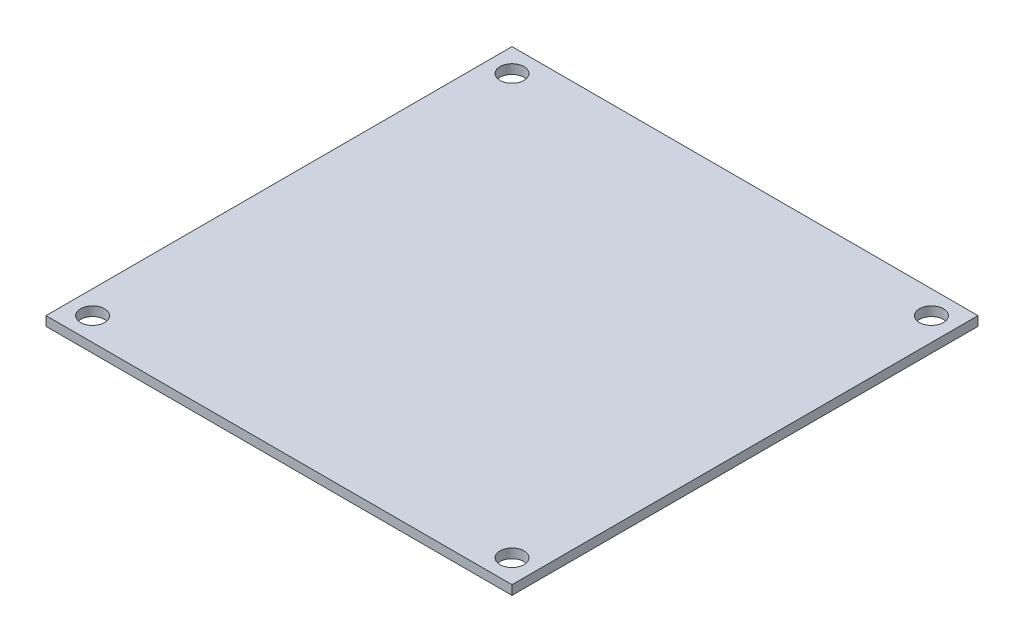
from build123d import *

# Parameters (mm, degrees)
SKETCH1_W                 = 63.5
SKETCH1_H                 = 63.5
EXTRUDE1_DEPTH            = 1.27
F_4_CLEARANCE_HOLE1_D     = 3.2639
F_4_CLEARANCE_HOLE1_DEPTH = 9.144
F_4_CLEARANCE_HOLE1_TIP   = 0.980574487


with BuildPart() as part:
    # Sketch1 → Extrude1 (new body)
    with BuildSketch(Plane(origin=(0, 0, 0), x_dir=(1, 0, 0), z_dir=(0, 1, 0))):
        with Locations((31.75, 31.75)):
            Rectangle(SKETCH1_W, SKETCH1_H)
    extrude(amount=-EXTRUDE1_DEPTH)

    # 4 Clearance Hole1
    with Locations(Plane(origin=(60.325, 0, -60.325), x_dir=(0, 0, 1), z_dir=(0, 1, 0))):
        with Locations((0, 0), (57.15, -57.15), (57.15, 0), (0, -57.15)):
            Hole(F_4_CLEARANCE_HOLE1_D / 2, depth=F_4_CLEARANCE_HOLE1_DEPTH)
            with Locations((0, 0, -(F_4_CLEARANCE_HOLE1_DEPTH + F_4_CLEARANCE_HOLE1_TIP / 2))):  # 118° drill point
                Cone(0, F_4_CLEARANCE_HOLE1_D / 2, F_4_CLEARANCE_HOLE1_TIP, mode=Mode.SUBTRACT)


solid = part.part
